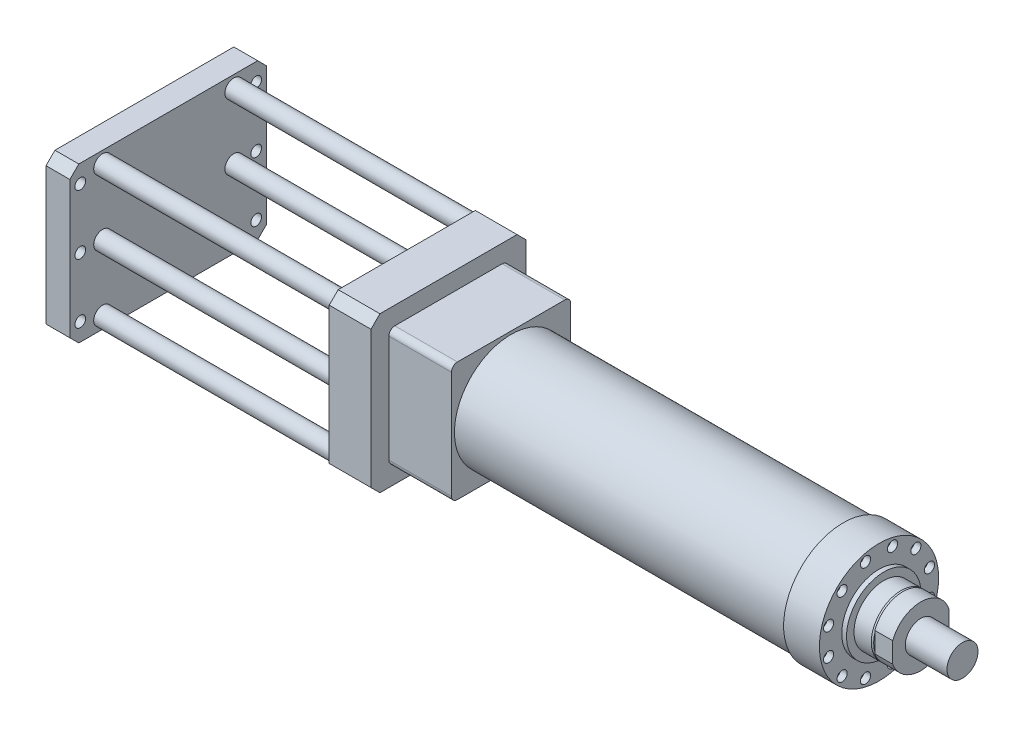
from build123d import *

# Parameters (mm, degrees)
SKETCH_1_R          = 95
SKETCH_1_R_2        = 80
EXTRUDE_1_DEPTH     = 557
SKETCH_2_R          = 100
EXTRUDE_2_DEPTH     = 60
SKETCH_3_R          = 62.5
EXTRUDE_3_DEPTH     = 8
SKETCH_4_R          = 8.5
CUT_EXTRUDE_3_DEPTH = 11
SKETCH_6_R          = 50
EXTRUDE_4_DEPTH     = 32
CHAMFER_1_SIZE      = 3
CHAMFER_1_SIZE2     = 1.091910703
EXTRUDE_5_DEPTH     = 30
SKETCH_8_R          = 26
CUT_EXTRUDE_4_DEPTH = 82
EXTRUDE_6_DEPTH     = 105
SKETCH_10_W         = 260
SKETCH_10_H         = 260
EXTRUDE_7_DEPTH     = 70
SKETCH_11_R         = 65
CUT_EXTRUDE_5_DEPTH = 30
SKETCH_12_R         = 55
CUT_EXTRUDE_6_DEPTH = 31
SKETCH_13_R         = 5
CUT_EXTRUDE_7_DEPTH = 20
EXTRUDE_START       = 70
SKETCH_14_R         = 26
EXTRUDE_8_DEPTH     = 70
EXTRUDE_START_2     = 400
SKETCH_15_W         = 330
SKETCH_15_H         = 260
SKETCH_15_R         = 9
EXTRUDE_9_DEPTH     = 40
SKETCH_16_R         = 15
EXTRUDE_10_DEPTH    = 400
CHAMFER_2_SIZE      = 15
CHAMFER_3_SIZE      = 15


with BuildPart() as part:
    # Sketch 1 → Extrude 1 (new body)
    with BuildSketch(Plane(origin=(0, 0, 0), x_dir=(0, 0, -1), z_dir=(1, 0, 0))):
        Circle(SKETCH_1_R)
        Circle(SKETCH_1_R_2, mode=Mode.SUBTRACT)
    extrude(amount=EXTRUDE_1_DEPTH)

    # Sketch 2 → Extrude 2 (add)
    with BuildSketch(Plane(origin=(557, 0, 0), x_dir=(0, 0, -1), z_dir=(1, 0, 0))):
        Circle(SKETCH_2_R)
    extrude(amount=EXTRUDE_2_DEPTH)

    # Sketch 3 → Extrude 3 (add)
    with BuildSketch(Plane(origin=(617, 0, 0), x_dir=(0, 0, -1), z_dir=(1, 0, 0))):
        Circle(SKETCH_3_R)
    extrude(amount=EXTRUDE_3_DEPTH)

    # Sketch 4 → Cut-Extrude 3 (cut)
    with BuildSketch(Plane(origin=(617, 0, 0), x_dir=(0, 0, -1), z_dir=(1, 0, 0))):
        with Locations((-22.646666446, 84.5185098)):
            Circle(SKETCH_4_R)
        with Locations((22.646666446, 84.5185098)):
            Circle(SKETCH_4_R)
        with Locations((61.871843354, 61.871843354)):
            Circle(SKETCH_4_R)
        with Locations((84.5185098, 22.646666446)):
            Circle(SKETCH_4_R)
        with Locations((84.5185098, -22.646666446)):
            Circle(SKETCH_4_R)
        with Locations((61.871843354, -61.871843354)):
            Circle(SKETCH_4_R)
        with Locations((22.646666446, -84.5185098)):
            Circle(SKETCH_4_R)
        with Locations((-22.646666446, -84.5185098)):
            Circle(SKETCH_4_R)
        with Locations((-61.871843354, -61.871843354)):
            Circle(SKETCH_4_R)
        with Locations((-84.5185098, -22.646666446)):
            Circle(SKETCH_4_R)
        with Locations((-84.5185098, 22.646666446)):
            Circle(SKETCH_4_R)
        with Locations((-61.871843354, 61.871843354)):
            Circle(SKETCH_4_R)
    extrude(amount=-CUT_EXTRUDE_3_DEPTH, mode=Mode.SUBTRACT)

    # Sketch 6 → Extrude 4 (add)
    with BuildSketch(Plane(origin=(625, 0, 0), x_dir=(0, 0, -1), z_dir=(1, 0, 0))):
        Circle(SKETCH_6_R)
    extrude(amount=EXTRUDE_4_DEPTH)

    # Chamfer 1
    chamfer_1_edges = [part.edges().sort_by_distance(p)[0] for p in [
        (657, 0, 50),
    ]]
    chamfer_1_side = [part.faces().sort_by_distance(p)[0] for p in [
        (641, 0, 50),
    ]]
    chamfer(chamfer_1_edges, length=CHAMFER_1_SIZE, length2=CHAMFER_1_SIZE2, reference=chamfer_1_side[0])

    # Sketch 7 → Extrude 5 (add)
    with BuildSketch(Plane(origin=(657, 0, 0), x_dir=(0, 0, -1), z_dir=(1, 0, 0))):
        with BuildLine():
            Line((-47, 17.058722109), (-47, -17.058722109))
            ThreePointArc((-47, -17.058722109), (0, -50), (47, -17.058722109))
            Line((47, -17.058722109), (47, 17.058722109))
            ThreePointArc((47, 17.058722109), (0, 50), (-47, 17.058722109))
        make_face()
    extrude(amount=EXTRUDE_5_DEPTH)

    # Sketch 8 → Cut-Extrude 4 (cut)
    with BuildSketch(Plane(origin=(687, 0, 0), x_dir=(0, 0, -1), z_dir=(1, 0, 0))):
        Circle(SKETCH_8_R)
    extrude(amount=-CUT_EXTRUDE_4_DEPTH, mode=Mode.SUBTRACT)

    # Sketch 9 → Extrude 6 (add)
    with BuildSketch(Plane.ZY):
        with BuildLine():
            Line((-90, 100), (90, 100))
            ThreePointArc((90, 100), (97.071067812, 97.071067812), (100, 90))
            Line((100, 90), (100, -90))
            ThreePointArc((100, -90), (97.071067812, -97.071067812), (90, -100))
            Line((90, -100), (-90, -100))
            ThreePointArc((-90, -100), (-97.071067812, -97.071067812), (-100, -90))
            Line((-100, -90), (-100, 90))
            ThreePointArc((-100, 90), (-97.071067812, 97.071067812), (-90, 100))
        make_face()
    extrude(amount=EXTRUDE_6_DEPTH)


with BuildPart() as body_2:
    # Sketch 10 → Extrude 7 (new body)
    with BuildSketch(Plane.ZY.offset(105)):
        Rectangle(SKETCH_10_W, SKETCH_10_H)
    extrude(amount=EXTRUDE_7_DEPTH)

    # Sketch 11 → Cut-Extrude 5 (cut)
    with BuildSketch(Plane.ZY.offset(175)):
        Circle(SKETCH_11_R)
    extrude(amount=-CUT_EXTRUDE_5_DEPTH, mode=Mode.SUBTRACT)

    # Sketch 12 → Cut-Extrude 6 (cut)
    with BuildSketch(Plane.ZY.offset(145)):
        Circle(SKETCH_12_R)
    extrude(amount=-CUT_EXTRUDE_6_DEPTH, mode=Mode.SUBTRACT)

    # Sketch 13 → Cut-Extrude 7 (cut)
    with BuildSketch(Plane.ZY.offset(175)):
        with Locations((-58.336309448, 58.336309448)):
            Circle(SKETCH_13_R)
        with Locations((58.336309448, 58.336309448)):
            Circle(SKETCH_13_R)
        with Locations((58.336309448, -58.336309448)):
            Circle(SKETCH_13_R)
        with Locations((-58.336309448, -58.336309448)):
            Circle(SKETCH_13_R)
    extrude(amount=-CUT_EXTRUDE_7_DEPTH, mode=Mode.SUBTRACT)

    # Sketch 16 → Extrude 10 (add)
    with BuildSketch(Plane.ZY.offset(175)):
        with Locations((110, 110)):
            Circle(SKETCH_16_R)
        with Locations((110, -110)):
            Circle(SKETCH_16_R)
        with Locations((-110, 0)):
            Circle(SKETCH_16_R)
        with Locations(Location((-110, -110, 0), (0, 0, 180))):
            Circle(SKETCH_16_R)
        with Locations(Location((-110, 110, 0), (0, 0, 180))):
            Circle(SKETCH_16_R)
        with Locations((110, 0)):
            Circle(SKETCH_16_R)
    extrude(amount=EXTRUDE_10_DEPTH)

    # Chamfer 2
    chamfer_2_edges = [body_2.edges().sort_by_distance(p)[0] for p in [
        (-140, -130, 130),
        (-140, -130, -130),
        (-140, 130, -130),
        (-140, 130, 130),
    ]]
    chamfer(chamfer_2_edges, length=CHAMFER_2_SIZE)


with BuildPart() as body_3:
    # Sketch 14 → Extrude 8 (new body)
    with BuildSketch(Plane(origin=(687, 0, 0), x_dir=(0, 0, -1), z_dir=(1, 0, 0)).offset(EXTRUDE_START)):
        Circle(SKETCH_14_R)
    extrude(amount=-EXTRUDE_8_DEPTH)


with BuildPart() as body_4:
    # Sketch 15 → Extrude 9 (new body)
    with BuildSketch(Plane.ZY.offset(175).offset(EXTRUDE_START_2)):
        Rectangle(SKETCH_15_W, SKETCH_15_H)
        with Locations((-147.5, 100)):
            Circle(SKETCH_15_R, mode=Mode.SUBTRACT)
        with Locations((-147.5, 0)):
            Circle(SKETCH_15_R, mode=Mode.SUBTRACT)
        with Locations((-147.5, -100)):
            Circle(SKETCH_15_R, mode=Mode.SUBTRACT)
        with Locations(Location((147.5, -100, 0), (0, 0, 180))):
            Circle(SKETCH_15_R, mode=Mode.SUBTRACT)
        with Locations(Location((147.5, 0, 0), (0, 0, 180))):
            Circle(SKETCH_15_R, mode=Mode.SUBTRACT)
        with Locations(Location((147.5, 100, 0), (0, 0, 180))):
            Circle(SKETCH_15_R, mode=Mode.SUBTRACT)
    extrude(amount=EXTRUDE_9_DEPTH)

    # Chamfer 3
    chamfer_3_edges = [body_4.edges().sort_by_distance(p)[0] for p in [
        (-595, -130, 165),
        (-595, -130, -165),
        (-595, 130, -165),
        (-595, 130, 165),
    ]]
    chamfer(chamfer_3_edges, length=CHAMFER_3_SIZE)


solid = Compound([part.part, body_2.part, body_3.part, body_4.part])
